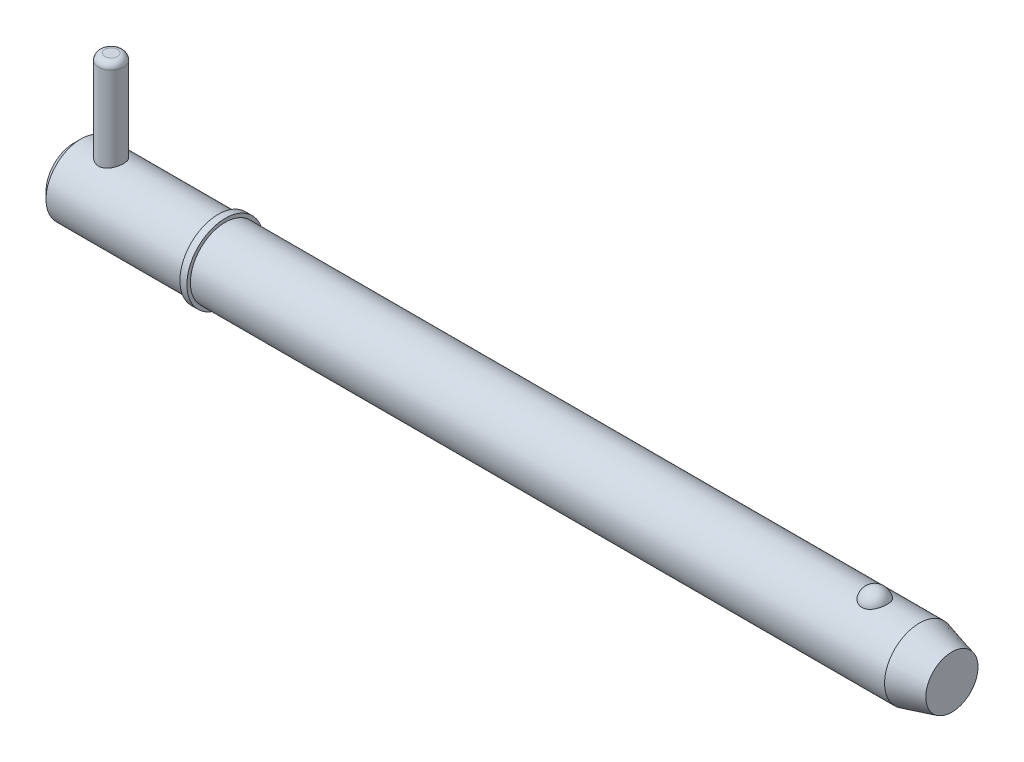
ISO-10303-21;
HEADER;
FILE_DESCRIPTION(('STEP AP214'),'2;1');
FILE_NAME('part.step','',(''),(''),'','','');
FILE_SCHEMA(('AUTOMOTIVE_DESIGN { 1 0 10303 214 1 1 1 1 }'));
ENDSEC;
DATA;
#1=APPLICATION_CONTEXT('core data for automotive mechanical design processes');
#2=APPLICATION_PROTOCOL_DEFINITION('international standard','automotive_design',2000,#1);
#3=PRODUCT_CONTEXT('',#1,'mechanical');
#4=PRODUCT('Part','Part','',(#3));
#5=PRODUCT_RELATED_PRODUCT_CATEGORY('part','',(#4));
#6=PRODUCT_DEFINITION_FORMATION('','',#4);
#7=PRODUCT_DEFINITION_CONTEXT('part definition',#1,'design');
#8=PRODUCT_DEFINITION('design','',#6,#7);
#9=PRODUCT_DEFINITION_SHAPE('','',#8);
#10=(LENGTH_UNIT() NAMED_UNIT(*) SI_UNIT(.MILLI.,.METRE.));
#11=(NAMED_UNIT(*) PLANE_ANGLE_UNIT() SI_UNIT($,.RADIAN.));
#12=(NAMED_UNIT(*) SI_UNIT($,.STERADIAN.) SOLID_ANGLE_UNIT());
#13=UNCERTAINTY_MEASURE_WITH_UNIT(LENGTH_MEASURE(1.E-05),#10,'distance_accuracy_value','');
#14=(GEOMETRIC_REPRESENTATION_CONTEXT(3) GLOBAL_UNCERTAINTY_ASSIGNED_CONTEXT((#13)) GLOBAL_UNIT_ASSIGNED_CONTEXT((#10,
#11,#12)) REPRESENTATION_CONTEXT('',''));
#15=CARTESIAN_POINT('',(0.,0.,0.));
#16=DIRECTION('',(0.,0.,1.));
#17=DIRECTION('',(1.,0.,0.));
#18=AXIS2_PLACEMENT_3D('',#15,#16,#17);
#19=CARTESIAN_POINT('',(5.94,19.845,0.));
#20=DIRECTION('',(0.,-1.,0.));
#21=DIRECTION('',(0.,0.,-1.));
#22=AXIS2_PLACEMENT_3D('',#19,#20,#21);
#23=CYLINDRICAL_SURFACE('',#22,1.98);
#24=CARTESIAN_POINT('',(5.94,-4.565,0.));
#25=DIRECTION('',(0.,1.,0.));
#26=DIRECTION('',(0.,0.,1.));
#27=AXIS2_PLACEMENT_3D('',#24,#25,#26);
#28=CIRCLE('',#27,1.98);
#29=CARTESIAN_POINT('',(5.94,-4.565,1.98));
#30=VERTEX_POINT('',#29);
#31=EDGE_CURVE('P0_E25',#30,#30,#28,.T.);
#32=ORIENTED_EDGE('',*,*,#31,.T.);
#33=EDGE_LOOP('',(#32));
#34=FACE_BOUND('',#33,.T.);
#35=CARTESIAN_POINT('',(5.94,18.855,0.));
#36=DIRECTION('',(0.,1.,0.));
#37=DIRECTION('',(0.,0.,1.));
#38=AXIS2_PLACEMENT_3D('',#35,#36,#37);
#39=CIRCLE('',#38,1.98);
#40=CARTESIAN_POINT('',(5.94,18.855,1.98));
#41=VERTEX_POINT('',#40);
#42=EDGE_CURVE('P0_E29',#41,#41,#39,.F.);
#43=ORIENTED_EDGE('',*,*,#42,.T.);
#44=EDGE_LOOP('',(#43));
#45=FACE_BOUND('',#44,.T.);
#46=ADVANCED_FACE('P0_F14',(#34,#45),#23,.T.);
#47=CARTESIAN_POINT('',(5.94,19.845,0.));
#48=DIRECTION('',(0.,1.,0.));
#49=DIRECTION('',(0.,0.,1.));
#50=AXIS2_PLACEMENT_3D('',#47,#48,#49);
#51=PLANE('',#50);
#52=CARTESIAN_POINT('',(5.94,19.845,0.));
#53=DIRECTION('',(0.,1.,0.));
#54=DIRECTION('',(0.,0.,1.));
#55=AXIS2_PLACEMENT_3D('',#52,#53,#54);
#56=CIRCLE('',#55,0.99);
#57=CARTESIAN_POINT('',(5.94,19.845,0.99));
#58=VERTEX_POINT('',#57);
#59=EDGE_CURVE('P0_E10',#58,#58,#56,.T.);
#60=ORIENTED_EDGE('',*,*,#59,.T.);
#61=EDGE_LOOP('',(#60));
#62=FACE_BOUND('',#61,.T.);
#63=ADVANCED_FACE('P0_F46',(#62),#51,.T.);
#64=CARTESIAN_POINT('',(5.94,-5.555,0.));
#65=DIRECTION('',(0.,1.,0.));
#66=DIRECTION('',(0.,0.,1.));
#67=AXIS2_PLACEMENT_3D('',#64,#65,#66);
#68=PLANE('',#67);
#69=CARTESIAN_POINT('',(5.94,-5.555,0.));
#70=DIRECTION('',(0.,1.,0.));
#71=DIRECTION('',(0.,0.,1.));
#72=AXIS2_PLACEMENT_3D('',#69,#70,#71);
#73=CIRCLE('',#72,0.99);
#74=CARTESIAN_POINT('',(5.94,-5.555,0.99));
#75=VERTEX_POINT('',#74);
#76=EDGE_CURVE('P0_E21',#75,#75,#73,.F.);
#77=ORIENTED_EDGE('',*,*,#76,.T.);
#78=EDGE_LOOP('',(#77));
#79=FACE_BOUND('',#78,.T.);
#80=ADVANCED_FACE('P0_F43',(#79),#68,.F.);
#81=CARTESIAN_POINT('',(5.94,-4.565,0.));
#82=DIRECTION('',(0.,1.,0.));
#83=DIRECTION('',(0.,0.,1.));
#84=AXIS2_PLACEMENT_3D('',#81,#82,#83);
#85=DEGENERATE_TOROIDAL_SURFACE('',#84,0.99,0.99,.T.);
#86=ORIENTED_EDGE('',*,*,#76,.F.);
#87=EDGE_LOOP('',(#86));
#88=FACE_BOUND('',#87,.T.);
#89=ORIENTED_EDGE('',*,*,#31,.F.);
#90=EDGE_LOOP('',(#89));
#91=FACE_BOUND('',#90,.T.);
#92=ADVANCED_FACE('P0_F38',(#88,#91),#85,.T.);
#93=CARTESIAN_POINT('',(5.94,18.855,0.));
#94=DIRECTION('',(0.,1.,0.));
#95=DIRECTION('',(0.,0.,1.));
#96=AXIS2_PLACEMENT_3D('',#93,#94,#95);
#97=DEGENERATE_TOROIDAL_SURFACE('',#96,0.99,0.99,.T.);
#98=ORIENTED_EDGE('',*,*,#42,.F.);
#99=EDGE_LOOP('',(#98));
#100=FACE_BOUND('',#99,.T.);
#101=ORIENTED_EDGE('',*,*,#59,.F.);
#102=EDGE_LOOP('',(#101));
#103=FACE_BOUND('',#102,.T.);
#104=ADVANCED_FACE('P0_F16',(#100,#103),#97,.T.);
#105=CLOSED_SHELL('',(#46,#63,#80,#92,#104));
#106=MANIFOLD_SOLID_BREP('P0_B1',#105);
#107=CARTESIAN_POINT('',(0.,0.,0.));
#108=DIRECTION('',(1.,0.,0.));
#109=DIRECTION('',(0.,0.,-1.));
#110=AXIS2_PLACEMENT_3D('',#107,#108,#109);
#111=CYLINDRICAL_SURFACE('',#110,5.555);
#112=CARTESIAN_POINT('',(134.817114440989,0.,0.));
#113=DIRECTION('',(1.,0.,0.));
#114=DIRECTION('',(0.,0.,-1.));
#115=AXIS2_PLACEMENT_3D('',#112,#113,#114);
#116=CIRCLE('',#115,5.555);
#117=CARTESIAN_POINT('',(134.817114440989,0.,-5.555));
#118=VERTEX_POINT('',#117);
#119=EDGE_CURVE('P1_E81',#118,#118,#116,.T.);
#120=ORIENTED_EDGE('',*,*,#119,.F.);
#121=EDGE_LOOP('',(#120));
#122=FACE_BOUND('',#121,.T.);
#123=CARTESIAN_POINT('',(24.13,0.,0.));
#124=DIRECTION('',(1.,0.,0.));
#125=DIRECTION('',(0.,0.,-1.));
#126=AXIS2_PLACEMENT_3D('',#123,#124,#125);
#127=CIRCLE('',#126,5.555);
#128=CARTESIAN_POINT('',(24.13,0.,-5.555));
#129=VERTEX_POINT('',#128);
#130=EDGE_CURVE('P1_E85',#129,#129,#127,.T.);
#131=ORIENTED_EDGE('',*,*,#130,.T.);
#132=EDGE_LOOP('',(#131));
#133=FACE_BOUND('',#132,.T.);
#134=CARTESIAN_POINT('',(127.698626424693,5.16741224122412,2.03859650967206));
#135=CARTESIAN_POINT('',(127.592949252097,5.16740893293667,2.03859990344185));
#136=CARTESIAN_POINT('',(127.48729894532,5.17079470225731,2.03008306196));
#137=CARTESIAN_POINT('',(127.279141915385,5.18392795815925,1.99630721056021));
#138=CARTESIAN_POINT('',(127.176634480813,5.19367399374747,1.97105201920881));
#139=CARTESIAN_POINT('',(126.977771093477,5.21839168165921,1.90463997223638));
#140=CARTESIAN_POINT('',(126.881406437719,5.23335573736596,1.86350622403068));
#141=CARTESIAN_POINT('',(126.697080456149,5.26688076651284,1.76652592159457));
#142=CARTESIAN_POINT('',(126.609120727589,5.28544242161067,1.71067657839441));
#143=CARTESIAN_POINT('',(126.441265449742,5.32479845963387,1.58399959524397));
#144=CARTESIAN_POINT('',(126.36166564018,5.34564089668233,1.51279545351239));
#145=CARTESIAN_POINT('',(126.21512901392,5.38697258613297,1.35828584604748));
#146=CARTESIAN_POINT('',(126.148194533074,5.40746177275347,1.27497815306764));
#147=CARTESIAN_POINT('',(126.02561039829,5.44694508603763,1.09440293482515));
#148=CARTESIAN_POINT('',(125.970598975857,5.46583143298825,0.99667783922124));
#149=CARTESIAN_POINT('',(125.876937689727,5.49908030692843,0.792961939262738));
#150=CARTESIAN_POINT('',(125.838289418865,5.513442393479,0.686970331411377));
#151=CARTESIAN_POINT('',(125.777680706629,5.536358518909,0.468019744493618));
#152=CARTESIAN_POINT('',(125.755972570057,5.54482455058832,0.354981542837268));
#153=CARTESIAN_POINT('',(125.730636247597,5.55473324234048,0.126595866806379));
#154=CARTESIAN_POINT('',(125.727007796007,5.55617600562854,0.011248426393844));
#155=CARTESIAN_POINT('',(125.737881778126,5.55189984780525,-0.218011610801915));
#156=CARTESIAN_POINT('',(125.752315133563,5.54620821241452,-0.331928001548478));
#157=CARTESIAN_POINT('',(125.798903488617,5.52828920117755,-0.555544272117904));
#158=CARTESIAN_POINT('',(125.831058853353,5.51606169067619,-0.665244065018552));
#159=CARTESIAN_POINT('',(125.912488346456,5.48630779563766,-0.877469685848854));
#160=CARTESIAN_POINT('',(125.961781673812,5.46877547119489,-0.979987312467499));
#161=CARTESIAN_POINT('',(126.076478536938,5.43024700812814,-1.17486975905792));
#162=CARTESIAN_POINT('',(126.141883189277,5.40925062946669,-1.26723387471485));
#163=CARTESIAN_POINT('',(126.287571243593,5.36600927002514,-1.43940133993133));
#164=CARTESIAN_POINT('',(126.367885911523,5.34376173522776,-1.51917763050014));
#165=CARTESIAN_POINT('',(126.541452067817,5.30057971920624,-1.66360338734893));
#166=CARTESIAN_POINT('',(126.634702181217,5.27964509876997,-1.72825445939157));
#167=CARTESIAN_POINT('',(126.829393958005,5.24205250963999,-1.83909478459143));
#168=CARTESIAN_POINT('',(126.930590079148,5.22530519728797,-1.88568407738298));
#169=CARTESIAN_POINT('',(127.140155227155,5.1975091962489,-1.9610080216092));
#170=CARTESIAN_POINT('',(127.248521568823,5.1864583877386,-1.98974931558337));
#171=CARTESIAN_POINT('',(127.463498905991,5.17184410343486,-2.0274226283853));
#172=CARTESIAN_POINT('',(127.569925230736,5.1679328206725,-2.03727608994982));
#173=CARTESIAN_POINT('',(127.782992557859,5.16698995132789,-2.03966777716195));
#174=CARTESIAN_POINT('',(127.889633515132,5.16995704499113,-2.03220932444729));
#175=CARTESIAN_POINT('',(128.096773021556,5.18222383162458,-2.00071170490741));
#176=CARTESIAN_POINT('',(128.197359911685,5.19133213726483,-1.97717337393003));
#177=CARTESIAN_POINT('',(128.393014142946,5.21467637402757,-1.91475248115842));
#178=CARTESIAN_POINT('',(128.488081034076,5.22891272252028,-1.87586867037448));
#179=CARTESIAN_POINT('',(128.672371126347,5.26137066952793,-1.78282713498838));
#180=CARTESIAN_POINT('',(128.761419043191,5.27967329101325,-1.7283512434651));
#181=CARTESIAN_POINT('',(128.929288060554,5.31817411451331,-1.60597483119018));
#182=CARTESIAN_POINT('',(129.008106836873,5.33837274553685,-1.53807126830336));
#183=CARTESIAN_POINT('',(129.157515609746,5.37968287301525,-1.38688970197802));
#184=CARTESIAN_POINT('',(129.227505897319,5.40079011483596,-1.30301744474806));
#185=CARTESIAN_POINT('',(129.353012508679,5.44074401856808,-1.1245817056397));
#186=CARTESIAN_POINT('',(129.408526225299,5.4595902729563,-1.03001630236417));
#187=CARTESIAN_POINT('',(129.505550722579,5.49369849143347,-0.829439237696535));
#188=CARTESIAN_POINT('',(129.54654838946,5.5088242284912,-0.72315564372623));
#189=CARTESIAN_POINT('',(129.611125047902,5.53310911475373,-0.504772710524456));
#190=CARTESIAN_POINT('',(129.634703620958,5.54226812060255,-0.392673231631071));
#191=CARTESIAN_POINT('',(129.664013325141,5.55370358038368,-0.165459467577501));
#192=CARTESIAN_POINT('',(129.669688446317,5.55595843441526,-0.050336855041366));
#193=CARTESIAN_POINT('',(129.662916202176,5.55329317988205,0.17928866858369));
#194=CARTESIAN_POINT('',(129.650469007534,5.54837313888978,0.293791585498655));
#195=CARTESIAN_POINT('',(129.607779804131,5.53189037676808,0.518526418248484));
#196=CARTESIAN_POINT('',(129.577598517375,5.5203503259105,0.628771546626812));
#197=CARTESIAN_POINT('',(129.500096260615,5.49182453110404,0.842318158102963));
#198=CARTESIAN_POINT('',(129.452774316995,5.47483847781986,0.945619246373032));
#199=CARTESIAN_POINT('',(129.341720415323,5.43710633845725,1.14281571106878));
#200=CARTESIAN_POINT('',(129.277921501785,5.41634501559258,1.23667048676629));
#201=CARTESIAN_POINT('',(129.135357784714,5.37334572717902,1.41185243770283));
#202=CARTESIAN_POINT('',(129.05659323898,5.35110778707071,1.49317982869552));
#203=CARTESIAN_POINT('',(128.886423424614,5.30779474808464,1.64049162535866));
#204=CARTESIAN_POINT('',(128.79510026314,5.28671324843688,1.70656877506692));
#205=CARTESIAN_POINT('',(128.601739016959,5.24804852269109,1.82201372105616));
#206=CARTESIAN_POINT('',(128.499700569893,5.23046541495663,1.87138095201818));
#207=CARTESIAN_POINT('',(128.283618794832,5.20042692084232,1.95335298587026));
#208=CARTESIAN_POINT('',(128.169260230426,5.18820192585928,1.98521734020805));
#209=CARTESIAN_POINT('',(127.936130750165,5.17169804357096,2.02783294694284));
#210=CARTESIAN_POINT('',(127.817361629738,5.16741595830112,2.03859269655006));
#211=CARTESIAN_POINT('',(127.698626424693,5.16741224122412,2.03859650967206));
#212=B_SPLINE_CURVE_WITH_KNOTS('',3,(#134,#135,#136,#137,#138,#139,#140,#141,#142,#143,#144,
#145,#146,#147,#148,#149,#150,#151,#152,#153,#154,#155,#156,#157,#158,#159,#160,#161,#162,#163,
#164,#165,#166,#167,#168,#169,#170,#171,#172,#173,#174,#175,#176,#177,#178,#179,#180,#181,#182,
#183,#184,#185,#186,#187,#188,#189,#190,#191,#192,#193,#194,#195,#196,#197,#198,#199,#200,#201,
#202,#203,#204,#205,#206,#207,#208,#209,#210,#211),.UNSPECIFIED.,.T.,.F.,(4,2,2,2,2,2,2,2,2,2,2,
2,2,2,2,2,2,2,2,2,2,2,2,2,2,2,2,2,2,2,2,2,2,2,2,2,2,2,4),(0.,0.316595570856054,
0.633118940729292,0.949183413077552,1.26530783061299,1.59030762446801,1.91536729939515,
2.25495824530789,2.59458224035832,2.93917283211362,3.28375835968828,3.6270300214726,
3.97030875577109,4.31397329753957,4.65766166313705,5.00207904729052,5.34645984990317,
5.68270547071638,6.01882587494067,6.33808403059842,6.65728093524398,6.966963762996,
7.27667180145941,7.59321535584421,7.90983070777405,8.24210387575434,8.57443684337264,
8.91755896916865,9.26068933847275,9.60489211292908,9.94909164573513,10.2921194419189,
10.6351667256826,10.9796305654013,11.3240884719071,11.6663928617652,12.0087088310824,
12.3645679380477,12.7202837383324),.UNSPECIFIED.);
#213=CARTESIAN_POINT('',(127.698626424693,5.16741224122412,2.03859650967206));
#214=VERTEX_POINT('',#213);
#215=EDGE_CURVE('P1_E35',#214,#214,#212,.T.);
#216=ORIENTED_EDGE('',*,*,#215,.T.);
#217=EDGE_LOOP('',(#216));
#218=FACE_BOUND('',#217,.T.);
#219=ADVANCED_FACE('P1_F13',(#122,#133,#218),#111,.T.);
#220=CARTESIAN_POINT('',(0.,0.,0.));
#221=DIRECTION('',(-1.,0.,0.));
#222=DIRECTION('',(0.,0.,1.));
#223=AXIS2_PLACEMENT_3D('',#220,#221,#222);
#224=PLANE('',#223);
#225=CARTESIAN_POINT('',(0.,0.,0.));
#226=DIRECTION('',(1.,0.,0.));
#227=DIRECTION('',(0.,0.,-1.));
#228=AXIS2_PLACEMENT_3D('',#225,#226,#227);
#229=CIRCLE('',#228,4.444);
#230=CARTESIAN_POINT('',(0.,0.,-4.444));
#231=VERTEX_POINT('',#230);
#232=EDGE_CURVE('P1_E9',#231,#231,#229,.T.);
#233=ORIENTED_EDGE('',*,*,#232,.F.);
#234=EDGE_LOOP('',(#233));
#235=FACE_BOUND('',#234,.T.);
#236=ADVANCED_FACE('P1_F15',(#235),#224,.T.);
#237=CARTESIAN_POINT('',(1.111,0.,0.));
#238=DIRECTION('',(1.,0.,0.));
#239=DIRECTION('',(0.,0.,-1.));
#240=AXIS2_PLACEMENT_3D('',#237,#238,#239);
#241=CONICAL_SURFACE('',#240,5.555,0.78539816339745);
#242=ORIENTED_EDGE('',*,*,#232,.T.);
#243=EDGE_LOOP('',(#242));
#244=FACE_BOUND('',#243,.T.);
#245=CARTESIAN_POINT('',(1.111,0.,0.));
#246=DIRECTION('',(1.,0.,0.));
#247=DIRECTION('',(0.,0.,-1.));
#248=AXIS2_PLACEMENT_3D('',#245,#246,#247);
#249=CIRCLE('',#248,5.555);
#250=CARTESIAN_POINT('',(1.111,0.,-5.555));
#251=VERTEX_POINT('',#250);
#252=EDGE_CURVE('P1_E26',#251,#251,#249,.T.);
#253=ORIENTED_EDGE('',*,*,#252,.F.);
#254=EDGE_LOOP('',(#253));
#255=FACE_BOUND('',#254,.T.);
#256=ADVANCED_FACE('P1_F77',(#244,#255),#241,.T.);
#257=CARTESIAN_POINT('',(0.,0.,0.));
#258=DIRECTION('',(1.,0.,0.));
#259=DIRECTION('',(0.,0.,-1.));
#260=AXIS2_PLACEMENT_3D('',#257,#258,#259);
#261=CYLINDRICAL_SURFACE('',#260,5.555);
#262=CARTESIAN_POINT('',(5.94,-5.19014691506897,1.98));
#263=CARTESIAN_POINT('',(5.83264687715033,-5.19014494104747,1.98000226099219));
#264=CARTESIAN_POINT('',(5.7253094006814,-5.19351395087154,1.97123988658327));
#265=CARTESIAN_POINT('',(5.51384517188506,-5.20654291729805,1.93656219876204));
#266=CARTESIAN_POINT('',(5.40971858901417,-5.21620320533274,1.91064598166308));
#267=CARTESIAN_POINT('',(5.20778082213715,-5.24058443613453,1.84271148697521));
#268=CARTESIAN_POINT('',(5.10995634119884,-5.25529427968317,1.80072850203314));
#269=CARTESIAN_POINT('',(4.92270352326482,-5.28810012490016,1.70197537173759));
#270=CARTESIAN_POINT('',(4.83327743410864,-5.3061970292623,1.64520128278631));
#271=CARTESIAN_POINT('',(4.66135184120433,-5.34464714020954,1.51575187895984));
#272=CARTESIAN_POINT('',(4.57928277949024,-5.36506222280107,1.44252311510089));
#273=CARTESIAN_POINT('',(4.42829115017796,-5.40532920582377,1.28342047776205));
#274=CARTESIAN_POINT('',(4.35937105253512,-5.42518099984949,1.19754423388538));
#275=CARTESIAN_POINT('',(4.23461605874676,-5.46281133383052,1.01237205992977));
#276=CARTESIAN_POINT('',(4.17924129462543,-5.48050875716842,0.912748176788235));
#277=CARTESIAN_POINT('',(4.0862117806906,-5.51109938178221,0.70485824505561));
#278=CARTESIAN_POINT('',(4.0485515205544,-5.52399407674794,0.596594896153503));
#279=CARTESIAN_POINT('',(3.99350662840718,-5.54308759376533,0.379019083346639));
#280=CARTESIAN_POINT('',(3.97538263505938,-5.54952987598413,0.269915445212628));
#281=CARTESIAN_POINT('',(3.95756405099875,-5.55586205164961,0.0500378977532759));
#282=CARTESIAN_POINT('',(3.95786404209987,-5.55575387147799,-0.060735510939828));
#283=CARTESIAN_POINT('',(3.97643665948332,-5.54915684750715,-0.275539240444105));
#284=CARTESIAN_POINT('',(3.99390415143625,-5.54295384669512,-0.379649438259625));
#285=CARTESIAN_POINT('',(4.0449721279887,-5.52523170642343,-0.583350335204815));
#286=CARTESIAN_POINT('',(4.07857373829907,-5.51371219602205,-0.682940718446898));
#287=CARTESIAN_POINT('',(4.16137312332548,-5.4863099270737,-0.876423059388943));
#288=CARTESIAN_POINT('',(4.2107826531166,-5.47036834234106,-0.970215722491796));
#289=CARTESIAN_POINT('',(4.32361427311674,-5.43575653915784,-1.1484017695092));
#290=CARTESIAN_POINT('',(4.38704062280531,-5.41708549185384,-1.23279228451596));
#291=CARTESIAN_POINT('',(4.53006791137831,-5.37778429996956,-1.39454579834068));
#292=CARTESIAN_POINT('',(4.61035105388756,-5.35710277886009,-1.4712940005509));
#293=CARTESIAN_POINT('',(4.78279835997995,-5.31692766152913,-1.6104545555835));
#294=CARTESIAN_POINT('',(4.874964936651,-5.29743430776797,-1.67286398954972));
#295=CARTESIAN_POINT('',(5.07076688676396,-5.26153775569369,-1.78259698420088));
#296=CARTESIAN_POINT('',(5.17458163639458,-5.24519780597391,-1.8296227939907));
#297=CARTESIAN_POINT('',(5.38938990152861,-5.21818744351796,-1.90530278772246));
#298=CARTESIAN_POINT('',(5.50037985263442,-5.20751423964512,-1.93396601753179));
#299=CARTESIAN_POINT('',(5.72036376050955,-5.19369176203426,-1.97077654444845));
#300=CARTESIAN_POINT('',(5.82917370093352,-5.19018851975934,-1.97989015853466));
#301=CARTESIAN_POINT('',(6.04680100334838,-5.19010609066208,-1.98010779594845));
#302=CARTESIAN_POINT('',(6.15561835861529,-5.19352540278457,-1.97121572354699));
#303=CARTESIAN_POINT('',(6.36548036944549,-5.20654623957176,-1.93654727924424));
#304=CARTESIAN_POINT('',(6.46666051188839,-5.21588705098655,-1.91148218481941));
#305=CARTESIAN_POINT('',(6.66334537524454,-5.23939939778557,-1.84605494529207));
#306=CARTESIAN_POINT('',(6.75884899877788,-5.25357186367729,-1.8056898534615));
#307=CARTESIAN_POINT('',(6.94517989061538,-5.28576258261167,-1.70921153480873));
#308=CARTESIAN_POINT('',(7.03572661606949,-5.30389804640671,-1.65259670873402));
#309=CARTESIAN_POINT('',(7.20638087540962,-5.34176077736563,-1.52577523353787));
#310=CARTESIAN_POINT('',(7.28648490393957,-5.36148857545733,-1.45556404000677));
#311=CARTESIAN_POINT('',(7.43864697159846,-5.40165494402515,-1.2988614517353));
#312=CARTESIAN_POINT('',(7.50999887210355,-5.42207106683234,-1.21167640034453));
#313=CARTESIAN_POINT('',(7.63712639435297,-5.46023601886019,-1.026066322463));
#314=CARTESIAN_POINT('',(7.69290228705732,-5.47798489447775,-0.927641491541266));
#315=CARTESIAN_POINT('',(7.78684673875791,-5.50876590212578,-0.722633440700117));
#316=CARTESIAN_POINT('',(7.82510508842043,-5.52182201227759,-0.616095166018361));
#317=CARTESIAN_POINT('',(7.88297051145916,-5.54184206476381,-0.397530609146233));
#318=CARTESIAN_POINT('',(7.90258540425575,-5.5488085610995,-0.285506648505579));
#319=CARTESIAN_POINT('',(7.9218262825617,-5.55564472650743,-0.065566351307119));
#320=CARTESIAN_POINT('',(7.92245987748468,-5.55587212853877,0.0422515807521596));
#321=CARTESIAN_POINT('',(7.90626329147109,-5.55011340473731,0.256387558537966));
#322=CARTESIAN_POINT('',(7.88943488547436,-5.54412791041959,0.362705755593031));
#323=CARTESIAN_POINT('',(7.83948457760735,-5.52676548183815,0.568649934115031));
#324=CARTESIAN_POINT('',(7.8067003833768,-5.51550046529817,0.668367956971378));
#325=CARTESIAN_POINT('',(7.72609369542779,-5.48874437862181,0.860911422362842));
#326=CARTESIAN_POINT('',(7.67826838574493,-5.47325251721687,0.953735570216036));
#327=CARTESIAN_POINT('',(7.56675024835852,-5.43884382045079,1.13391068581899));
#328=CARTESIAN_POINT('',(7.50249968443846,-5.41981485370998,1.22089468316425));
#329=CARTESIAN_POINT('',(7.36086495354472,-5.38069275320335,1.38316665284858));
#330=CARTESIAN_POINT('',(7.28347630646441,-5.36059925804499,1.45845061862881));
#331=CARTESIAN_POINT('',(7.11347587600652,-5.32048380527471,1.59876646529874));
#332=CARTESIAN_POINT('',(7.02032386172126,-5.30050854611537,1.66315951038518));
#333=CARTESIAN_POINT('',(6.82388804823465,-5.26398994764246,1.77536801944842));
#334=CARTESIAN_POINT('',(6.7206049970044,-5.24744635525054,1.82318470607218));
#335=CARTESIAN_POINT('',(6.50639706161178,-5.21987969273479,1.90068230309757));
#336=CARTESIAN_POINT('',(6.3954529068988,-5.20887116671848,1.93031547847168));
#337=CARTESIAN_POINT('',(6.16966522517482,-5.19400760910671,1.96996824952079));
#338=CARTESIAN_POINT('',(6.05482366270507,-5.19014902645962,1.97999758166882));
#339=CARTESIAN_POINT('',(5.94,-5.19014691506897,1.98));
#340=B_SPLINE_CURVE_WITH_KNOTS('',3,(#262,#263,#264,#265,#266,#267,#268,#269,#270,#271,#272,
#273,#274,#275,#276,#277,#278,#279,#280,#281,#282,#283,#284,#285,#286,#287,#288,#289,#290,#291,
#292,#293,#294,#295,#296,#297,#298,#299,#300,#301,#302,#303,#304,#305,#306,#307,#308,#309,#310,
#311,#312,#313,#314,#315,#316,#317,#318,#319,#320,#321,#322,#323,#324,#325,#326,#327,#328,#329,
#330,#331,#332,#333,#334,#335,#336,#337,#338,#339),.UNSPECIFIED.,.T.,.F.,(4,2,2,2,2,2,2,2,2,2,2,
2,2,2,2,2,2,2,2,2,2,2,2,2,2,2,2,2,2,2,2,2,2,2,2,2,2,2,4),(0.,0.321632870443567,
0.643282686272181,0.964229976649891,1.28526292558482,1.61937087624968,1.9535415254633,
2.29784481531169,2.64204093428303,2.97269632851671,3.30325448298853,3.61901541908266,
3.93479838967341,4.25500220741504,4.57530346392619,4.91268648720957,5.25013812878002,
5.59378026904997,5.93725299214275,6.26331481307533,6.58930593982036,6.90185604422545,
7.21446637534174,7.53801472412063,7.86167140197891,8.20353561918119,8.54539388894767,
8.88547970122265,9.22542281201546,9.54728637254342,9.86911722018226,10.1844146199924,
10.4997710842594,10.827730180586,11.1558013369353,11.499115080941,11.8424034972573,
12.1865892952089,12.5306041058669),.UNSPECIFIED.);
#341=CARTESIAN_POINT('',(5.94,-5.19014691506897,1.98));
#342=VERTEX_POINT('',#341);
#343=EDGE_CURVE('P1_E17',#342,#342,#340,.T.);
#344=ORIENTED_EDGE('',*,*,#343,.F.);
#345=EDGE_LOOP('',(#344));
#346=FACE_BOUND('',#345,.T.);
#347=CARTESIAN_POINT('',(5.94,5.19014691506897,1.98));
#348=CARTESIAN_POINT('',(6.04735312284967,5.19014494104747,1.98000226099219));
#349=CARTESIAN_POINT('',(6.1546905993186,5.19351395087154,1.97123988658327));
#350=CARTESIAN_POINT('',(6.36615482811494,5.20654291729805,1.93656219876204));
#351=CARTESIAN_POINT('',(6.47028141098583,5.21620320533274,1.91064598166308));
#352=CARTESIAN_POINT('',(6.67221917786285,5.24058443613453,1.84271148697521));
#353=CARTESIAN_POINT('',(6.77004365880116,5.25529427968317,1.80072850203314));
#354=CARTESIAN_POINT('',(6.95729647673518,5.28810012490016,1.70197537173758));
#355=CARTESIAN_POINT('',(7.04672256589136,5.3061970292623,1.64520128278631));
#356=CARTESIAN_POINT('',(7.21864815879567,5.34464714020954,1.51575187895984));
#357=CARTESIAN_POINT('',(7.30071722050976,5.36506222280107,1.44252311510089));
#358=CARTESIAN_POINT('',(7.45170884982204,5.40532920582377,1.28342047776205));
#359=CARTESIAN_POINT('',(7.52062894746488,5.42518099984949,1.19754423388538));
#360=CARTESIAN_POINT('',(7.64538394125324,5.46281133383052,1.01237205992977));
#361=CARTESIAN_POINT('',(7.70075870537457,5.48050875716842,0.912748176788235));
#362=CARTESIAN_POINT('',(7.7937882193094,5.51109938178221,0.704858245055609));
#363=CARTESIAN_POINT('',(7.8314484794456,5.52399407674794,0.596594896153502));
#364=CARTESIAN_POINT('',(7.88649337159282,5.54308759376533,0.379019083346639));
#365=CARTESIAN_POINT('',(7.90461736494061,5.54952987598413,0.269915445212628));
#366=CARTESIAN_POINT('',(7.92243594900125,5.55586205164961,0.0500378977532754));
#367=CARTESIAN_POINT('',(7.92213595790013,5.55575387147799,-0.0607355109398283));
#368=CARTESIAN_POINT('',(7.90356334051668,5.54915684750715,-0.275539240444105));
#369=CARTESIAN_POINT('',(7.88609584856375,5.54295384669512,-0.379649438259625));
#370=CARTESIAN_POINT('',(7.8350278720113,5.52523170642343,-0.583350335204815));
#371=CARTESIAN_POINT('',(7.80142626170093,5.51371219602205,-0.682940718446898));
#372=CARTESIAN_POINT('',(7.71862687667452,5.4863099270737,-0.876423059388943));
#373=CARTESIAN_POINT('',(7.6692173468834,5.47036834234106,-0.970215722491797));
#374=CARTESIAN_POINT('',(7.55638572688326,5.43575653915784,-1.1484017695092));
#375=CARTESIAN_POINT('',(7.49295937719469,5.41708549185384,-1.23279228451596));
#376=CARTESIAN_POINT('',(7.34993208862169,5.37778429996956,-1.39454579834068));
#377=CARTESIAN_POINT('',(7.26964894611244,5.35710277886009,-1.4712940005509));
#378=CARTESIAN_POINT('',(7.09720164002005,5.31692766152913,-1.6104545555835));
#379=CARTESIAN_POINT('',(7.00503506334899,5.29743430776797,-1.67286398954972));
#380=CARTESIAN_POINT('',(6.80923311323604,5.26153775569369,-1.78259698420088));
#381=CARTESIAN_POINT('',(6.70541836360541,5.24519780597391,-1.8296227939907));
#382=CARTESIAN_POINT('',(6.49061009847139,5.21818744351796,-1.90530278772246));
#383=CARTESIAN_POINT('',(6.37962014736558,5.20751423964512,-1.93396601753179));
#384=CARTESIAN_POINT('',(6.15963623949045,5.19369176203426,-1.97077654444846));
#385=CARTESIAN_POINT('',(6.05082629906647,5.19018851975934,-1.97989015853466));
#386=CARTESIAN_POINT('',(5.83319899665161,5.19010609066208,-1.98010779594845));
#387=CARTESIAN_POINT('',(5.7243816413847,5.19352540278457,-1.97121572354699));
#388=CARTESIAN_POINT('',(5.5145196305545,5.20654623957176,-1.93654727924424));
#389=CARTESIAN_POINT('',(5.4133394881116,5.21588705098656,-1.91148218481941));
#390=CARTESIAN_POINT('',(5.21665462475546,5.23939939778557,-1.84605494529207));
#391=CARTESIAN_POINT('',(5.12115100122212,5.25357186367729,-1.8056898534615));
#392=CARTESIAN_POINT('',(4.93482010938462,5.28576258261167,-1.70921153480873));
#393=CARTESIAN_POINT('',(4.84427338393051,5.30389804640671,-1.65259670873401));
#394=CARTESIAN_POINT('',(4.67361912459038,5.34176077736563,-1.52577523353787));
#395=CARTESIAN_POINT('',(4.59351509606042,5.36148857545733,-1.45556404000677));
#396=CARTESIAN_POINT('',(4.44135302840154,5.40165494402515,-1.2988614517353));
#397=CARTESIAN_POINT('',(4.37000112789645,5.42207106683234,-1.21167640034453));
#398=CARTESIAN_POINT('',(4.24287360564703,5.46023601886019,-1.026066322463));
#399=CARTESIAN_POINT('',(4.18709771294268,5.47798489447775,-0.927641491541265));
#400=CARTESIAN_POINT('',(4.09315326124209,5.50876590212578,-0.722633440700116));
#401=CARTESIAN_POINT('',(4.05489491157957,5.52182201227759,-0.61609516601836));
#402=CARTESIAN_POINT('',(3.99702948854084,5.54184206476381,-0.397530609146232));
#403=CARTESIAN_POINT('',(3.97741459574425,5.5488085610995,-0.285506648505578));
#404=CARTESIAN_POINT('',(3.9581737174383,5.55564472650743,-0.0655663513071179));
#405=CARTESIAN_POINT('',(3.95754012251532,5.55587212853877,0.0422515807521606));
#406=CARTESIAN_POINT('',(3.97373670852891,5.55011340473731,0.256387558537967));
#407=CARTESIAN_POINT('',(3.99056511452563,5.54412791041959,0.362705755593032));
#408=CARTESIAN_POINT('',(4.04051542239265,5.52676548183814,0.568649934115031));
#409=CARTESIAN_POINT('',(4.07329961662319,5.51550046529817,0.668367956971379));
#410=CARTESIAN_POINT('',(4.15390630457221,5.48874437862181,0.860911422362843));
#411=CARTESIAN_POINT('',(4.20173161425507,5.47325251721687,0.953735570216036));
#412=CARTESIAN_POINT('',(4.31324975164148,5.43884382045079,1.13391068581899));
#413=CARTESIAN_POINT('',(4.37750031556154,5.41981485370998,1.22089468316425));
#414=CARTESIAN_POINT('',(4.51913504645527,5.38069275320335,1.38316665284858));
#415=CARTESIAN_POINT('',(4.59652369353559,5.36059925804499,1.45845061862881));
#416=CARTESIAN_POINT('',(4.76652412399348,5.32048380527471,1.59876646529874));
#417=CARTESIAN_POINT('',(4.85967613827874,5.30050854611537,1.66315951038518));
#418=CARTESIAN_POINT('',(5.05611195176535,5.26398994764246,1.77536801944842));
#419=CARTESIAN_POINT('',(5.1593950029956,5.24744635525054,1.82318470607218));
#420=CARTESIAN_POINT('',(5.37360293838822,5.21987969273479,1.90068230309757));
#421=CARTESIAN_POINT('',(5.4845470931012,5.20887116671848,1.93031547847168));
#422=CARTESIAN_POINT('',(5.71033477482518,5.19400760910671,1.96996824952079));
#423=CARTESIAN_POINT('',(5.82517633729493,5.19014902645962,1.97999758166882));
#424=CARTESIAN_POINT('',(5.94,5.19014691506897,1.98));
#425=B_SPLINE_CURVE_WITH_KNOTS('',3,(#347,#348,#349,#350,#351,#352,#353,#354,#355,#356,#357,
#358,#359,#360,#361,#362,#363,#364,#365,#366,#367,#368,#369,#370,#371,#372,#373,#374,#375,#376,
#377,#378,#379,#380,#381,#382,#383,#384,#385,#386,#387,#388,#389,#390,#391,#392,#393,#394,#395,
#396,#397,#398,#399,#400,#401,#402,#403,#404,#405,#406,#407,#408,#409,#410,#411,#412,#413,#414,
#415,#416,#417,#418,#419,#420,#421,#422,#423,#424),.UNSPECIFIED.,.T.,.F.,(4,2,2,2,2,2,2,2,2,2,2,
2,2,2,2,2,2,2,2,2,2,2,2,2,2,2,2,2,2,2,2,2,2,2,2,2,2,2,4),(0.,0.321632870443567,
0.643282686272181,0.964229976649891,1.28526292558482,1.61937087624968,1.9535415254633,
2.29784481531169,2.64204093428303,2.97269632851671,3.30325448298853,3.61901541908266,
3.93479838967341,4.25500220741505,4.57530346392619,4.91268648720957,5.25013812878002,
5.59378026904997,5.93725299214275,6.26331481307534,6.58930593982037,6.90185604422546,
7.21446637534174,7.53801472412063,7.86167140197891,8.20353561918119,8.54539388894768,
8.88547970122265,9.22542281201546,9.54728637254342,9.86911722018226,10.1844146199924,
10.4997710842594,10.827730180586,11.1558013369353,11.499115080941,11.8424034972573,
12.1865892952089,12.5306041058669),.UNSPECIFIED.);
#426=CARTESIAN_POINT('',(5.94,5.19014691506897,1.98));
#427=VERTEX_POINT('',#426);
#428=EDGE_CURVE('P1_E43',#427,#427,#425,.T.);
#429=ORIENTED_EDGE('',*,*,#428,.F.);
#430=EDGE_LOOP('',(#429));
#431=FACE_BOUND('',#430,.T.);
#432=ORIENTED_EDGE('',*,*,#252,.T.);
#433=EDGE_LOOP('',(#432));
#434=FACE_BOUND('',#433,.T.);
#435=CARTESIAN_POINT('',(23.019,0.,0.));
#436=DIRECTION('',(1.,0.,0.));
#437=DIRECTION('',(0.,0.,-1.));
#438=AXIS2_PLACEMENT_3D('',#435,#436,#437);
#439=CIRCLE('',#438,5.555);
#440=CARTESIAN_POINT('',(23.019,0.,-5.555));
#441=VERTEX_POINT('',#440);
#442=EDGE_CURVE('P1_E31',#441,#441,#439,.T.);
#443=ORIENTED_EDGE('',*,*,#442,.F.);
#444=EDGE_LOOP('',(#443));
#445=FACE_BOUND('',#444,.T.);
#446=ADVANCED_FACE('P1_F103',(#346,#431,#434,#445),#261,.T.);
#447=CARTESIAN_POINT('',(23.019,5.555,0.));
#448=DIRECTION('',(-1.,0.,0.));
#449=DIRECTION('',(0.,0.,1.));
#450=AXIS2_PLACEMENT_3D('',#447,#448,#449);
#451=PLANE('',#450);
#452=ORIENTED_EDGE('',*,*,#442,.T.);
#453=EDGE_LOOP('',(#452));
#454=FACE_BOUND('',#453,.T.);
#455=CARTESIAN_POINT('',(23.019,0.,0.));
#456=DIRECTION('',(1.,0.,0.));
#457=DIRECTION('',(0.,0.,-1.));
#458=AXIS2_PLACEMENT_3D('',#455,#456,#457);
#459=CIRCLE('',#458,6.1105);
#460=CARTESIAN_POINT('',(23.019,0.,-6.1105));
#461=VERTEX_POINT('',#460);
#462=EDGE_CURVE('P1_E91',#461,#461,#459,.T.);
#463=ORIENTED_EDGE('',*,*,#462,.F.);
#464=EDGE_LOOP('',(#463));
#465=FACE_BOUND('',#464,.T.);
#466=ADVANCED_FACE('P1_F100',(#454,#465),#451,.T.);
#467=CARTESIAN_POINT('',(0.,0.,0.));
#468=DIRECTION('',(1.,0.,0.));
#469=DIRECTION('',(0.,0.,-1.));
#470=AXIS2_PLACEMENT_3D('',#467,#468,#469);
#471=CYLINDRICAL_SURFACE('',#470,6.1105);
#472=ORIENTED_EDGE('',*,*,#462,.T.);
#473=EDGE_LOOP('',(#472));
#474=FACE_BOUND('',#473,.T.);
#475=CARTESIAN_POINT('',(24.13,0.,0.));
#476=DIRECTION('',(1.,0.,0.));
#477=DIRECTION('',(0.,0.,-1.));
#478=AXIS2_PLACEMENT_3D('',#475,#476,#477);
#479=CIRCLE('',#478,6.1105);
#480=CARTESIAN_POINT('',(24.13,0.,-6.1105));
#481=VERTEX_POINT('',#480);
#482=EDGE_CURVE('P1_E88',#481,#481,#479,.T.);
#483=ORIENTED_EDGE('',*,*,#482,.F.);
#484=EDGE_LOOP('',(#483));
#485=FACE_BOUND('',#484,.T.);
#486=ADVANCED_FACE('P1_F68',(#474,#485),#471,.T.);
#487=CARTESIAN_POINT('',(24.13,6.1105,0.));
#488=DIRECTION('',(1.,0.,0.));
#489=DIRECTION('',(0.,0.,-1.));
#490=AXIS2_PLACEMENT_3D('',#487,#488,#489);
#491=PLANE('',#490);
#492=ORIENTED_EDGE('',*,*,#482,.T.);
#493=EDGE_LOOP('',(#492));
#494=FACE_BOUND('',#493,.T.);
#495=ORIENTED_EDGE('',*,*,#130,.F.);
#496=EDGE_LOOP('',(#495));
#497=FACE_BOUND('',#496,.T.);
#498=ADVANCED_FACE('P1_F62',(#494,#497),#491,.T.);
#499=CARTESIAN_POINT('',(140.,0.,0.));
#500=DIRECTION('',(-1.,0.,0.));
#501=DIRECTION('',(0.,0.,1.));
#502=AXIS2_PLACEMENT_3D('',#499,#500,#501);
#503=CONICAL_SURFACE('',#502,4.16625000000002,0.26179938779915);
#504=ORIENTED_EDGE('',*,*,#119,.T.);
#505=EDGE_LOOP('',(#504));
#506=FACE_BOUND('',#505,.T.);
#507=CARTESIAN_POINT('',(140.,0.,0.));
#508=DIRECTION('',(1.,0.,0.));
#509=DIRECTION('',(0.,0.,-1.));
#510=AXIS2_PLACEMENT_3D('',#507,#508,#509);
#511=CIRCLE('',#510,4.16625000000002);
#512=CARTESIAN_POINT('',(140.,0.,-4.16625000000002));
#513=VERTEX_POINT('',#512);
#514=EDGE_CURVE('P1_E42',#513,#513,#511,.T.);
#515=ORIENTED_EDGE('',*,*,#514,.F.);
#516=EDGE_LOOP('',(#515));
#517=FACE_BOUND('',#516,.T.);
#518=ADVANCED_FACE('P1_F59',(#506,#517),#503,.T.);
#519=CARTESIAN_POINT('',(140.,4.16625000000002,0.));
#520=DIRECTION('',(1.,0.,0.));
#521=DIRECTION('',(0.,0.,-1.));
#522=AXIS2_PLACEMENT_3D('',#519,#520,#521);
#523=PLANE('',#522);
#524=ORIENTED_EDGE('',*,*,#514,.T.);
#525=EDGE_LOOP('',(#524));
#526=FACE_BOUND('',#525,.T.);
#527=ADVANCED_FACE('P1_F55',(#526),#523,.T.);
#528=CARTESIAN_POINT('',(127.698626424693,4.9995,0.));
#529=DIRECTION('',(-1.,0.,0.));
#530=DIRECTION('',(0.,1.,0.));
#531=AXIS2_PLACEMENT_3D('',#528,#529,#530);
#532=SPHERICAL_SURFACE('',#531,2.04550000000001);
#533=ORIENTED_EDGE('',*,*,#215,.F.);
#534=EDGE_LOOP('',(#533));
#535=FACE_BOUND('',#534,.T.);
#536=ADVANCED_FACE('P1_F50',(#535),#532,.T.);
#537=CARTESIAN_POINT('',(5.94,-6.1105,0.));
#538=DIRECTION('',(0.,1.,0.));
#539=DIRECTION('',(0.,0.,1.));
#540=AXIS2_PLACEMENT_3D('',#537,#538,#539);
#541=CYLINDRICAL_SURFACE('',#540,1.98);
#542=ORIENTED_EDGE('',*,*,#343,.T.);
#543=EDGE_LOOP('',(#542));
#544=FACE_BOUND('',#543,.T.);
#545=ORIENTED_EDGE('',*,*,#428,.T.);
#546=EDGE_LOOP('',(#545));
#547=FACE_BOUND('',#546,.T.);
#548=ADVANCED_FACE('P1_F54',(#544,#547),#541,.F.);
#549=CLOSED_SHELL('',(#219,#236,#256,#446,#466,#486,#498,#518,#527,#536,#548));
#550=MANIFOLD_SOLID_BREP('P1_B1',#549);
#551=ADVANCED_BREP_SHAPE_REPRESENTATION('',(#18,#106,#550),#14);
#552=SHAPE_DEFINITION_REPRESENTATION(#9,#551);
ENDSEC;
END-ISO-10303-21;
